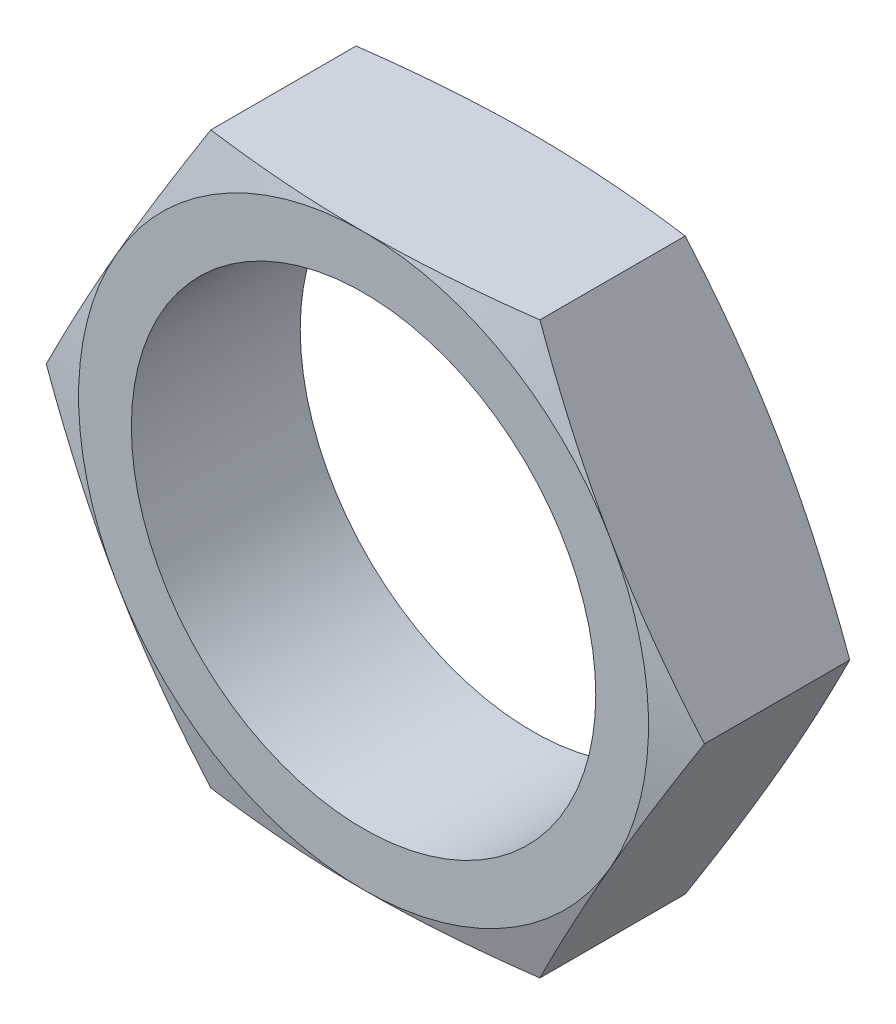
ISO-10303-21;
HEADER;
FILE_DESCRIPTION(('STEP AP214'),'2;1');
FILE_NAME('part.step','',(''),(''),'','','');
FILE_SCHEMA(('AUTOMOTIVE_DESIGN { 1 0 10303 214 1 1 1 1 }'));
ENDSEC;
DATA;
#1=APPLICATION_CONTEXT('core data for automotive mechanical design processes');
#2=APPLICATION_PROTOCOL_DEFINITION('international standard','automotive_design',2000,#1);
#3=PRODUCT_CONTEXT('',#1,'mechanical');
#4=PRODUCT('Part','Part','',(#3));
#5=PRODUCT_RELATED_PRODUCT_CATEGORY('part','',(#4));
#6=PRODUCT_DEFINITION_FORMATION('','',#4);
#7=PRODUCT_DEFINITION_CONTEXT('part definition',#1,'design');
#8=PRODUCT_DEFINITION('design','',#6,#7);
#9=PRODUCT_DEFINITION_SHAPE('','',#8);
#10=(LENGTH_UNIT() NAMED_UNIT(*) SI_UNIT(.MILLI.,.METRE.));
#11=(NAMED_UNIT(*) PLANE_ANGLE_UNIT() SI_UNIT($,.RADIAN.));
#12=(NAMED_UNIT(*) SI_UNIT($,.STERADIAN.) SOLID_ANGLE_UNIT());
#13=UNCERTAINTY_MEASURE_WITH_UNIT(LENGTH_MEASURE(1.E-05),#10,'distance_accuracy_value','');
#14=(GEOMETRIC_REPRESENTATION_CONTEXT(3) GLOBAL_UNCERTAINTY_ASSIGNED_CONTEXT((#13)) GLOBAL_UNIT_ASSIGNED_CONTEXT((#10,
#11,#12)) REPRESENTATION_CONTEXT('',''));
#15=CARTESIAN_POINT('',(0.,0.,0.));
#16=DIRECTION('',(0.,0.,1.));
#17=DIRECTION('',(1.,0.,0.));
#18=AXIS2_PLACEMENT_3D('',#15,#16,#17);
#19=CARTESIAN_POINT('',(0.,0.,8.));
#20=DIRECTION('',(0.,0.,-1.));
#21=DIRECTION('',(-1.,0.,0.));
#22=AXIS2_PLACEMENT_3D('',#19,#20,#21);
#23=CONICAL_SURFACE('',#22,13.5,1.30899693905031);
#24=CARTESIAN_POINT('',(6.92223115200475E-10,13.5,8.));
#25=CARTESIAN_POINT('',(-0.32607712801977,13.5,8.00001861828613));
#26=CARTESIAN_POINT('',(-0.65215132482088,13.5,7.99683485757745));
#27=CARTESIAN_POINT('',(-1.30416819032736,13.5,7.98419942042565));
#28=CARTESIAN_POINT('',(-1.63011086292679,13.5,7.9747479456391));
#29=CARTESIAN_POINT('',(-2.28139265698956,13.5,7.94972801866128));
#30=CARTESIAN_POINT('',(-2.60673204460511,13.5,7.93416647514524));
#31=CARTESIAN_POINT('',(-3.2570737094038,13.5,7.89718400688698));
#32=CARTESIAN_POINT('',(-3.5820759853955,13.5,7.87576306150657));
#33=CARTESIAN_POINT('',(-4.55629857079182,13.5,7.80319088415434));
#34=CARTESIAN_POINT('',(-5.20491563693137,13.5,7.74372302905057));
#35=CARTESIAN_POINT('',(-6.17663829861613,13.5,7.64016666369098));
#36=CARTESIAN_POINT('',(-6.50053840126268,13.5,7.603229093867));
#37=CARTESIAN_POINT('',(-7.14778905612,13.5,7.52498678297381));
#38=CARTESIAN_POINT('',(-7.47113964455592,13.5,7.48368234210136));
#39=CARTESIAN_POINT('',(-7.79422863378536,13.5,7.44039956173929));
#40=B_SPLINE_CURVE_WITH_KNOTS('',3,(#24,#25,#26,#27,#28,#29,#30,#31,#32,#33,#34,#35,#36,#37,#38,
#39),.UNSPECIFIED.,.F.,.F.,(4,2,2,2,2,2,2,4),(0.,0.978210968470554,1.9563904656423,
2.93346710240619,3.91054718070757,5.86416419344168,6.84214128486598,7.82005118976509),.UNSPECIFIED.);
#41=CARTESIAN_POINT('',(1.38444664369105E-09,13.5,8.));
#42=VERTEX_POINT('',#41);
#43=CARTESIAN_POINT('',(-7.79422863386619,13.5,7.44039956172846));
#44=VERTEX_POINT('',#43);
#45=EDGE_CURVE('E124',#42,#44,#40,.T.);
#46=ORIENTED_EDGE('',*,*,#45,.T.);
#47=CARTESIAN_POINT('',(-7.79422863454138,13.5000000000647,7.44039956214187));
#48=CARTESIAN_POINT('',(-7.95577312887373,13.2201967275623,7.48368234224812));
#49=CARTESIAN_POINT('',(-8.11744842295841,12.9401669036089,7.52498678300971));
#50=CARTESIAN_POINT('',(-8.44107375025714,12.3796313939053,7.60322909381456));
#51=CARTESIAN_POINT('',(-8.60302380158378,12.0991256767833,7.64016666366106));
#52=CARTESIAN_POINT('',(-9.08888513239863,11.2575891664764,7.74372302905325));
#53=CARTESIAN_POINT('',(-9.41319366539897,10.6958703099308,7.803190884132));
#54=CARTESIAN_POINT('',(-9.90030495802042,9.85216880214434,7.87576306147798));
#55=CARTESIAN_POINT('',(-10.0628060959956,9.57070857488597,7.89718400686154));
#56=CARTESIAN_POINT('',(-10.3879769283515,9.00749617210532,7.93416647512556));
#57=CARTESIAN_POINT('',(-10.5506466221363,8.72574399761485,7.94972801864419));
#58=CARTESIAN_POINT('',(-10.8762875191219,8.16171741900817,7.97474794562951));
#59=CARTESIAN_POINT('',(-11.0392588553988,7.87944278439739,7.98419942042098));
#60=CARTESIAN_POINT('',(-11.3652672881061,7.31477961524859,7.99683485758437));
#61=CARTESIAN_POINT('',(-11.5283043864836,7.03239107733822,8.00001861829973));
#62=CARTESIAN_POINT('',(-11.6913429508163,6.75000000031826,8.00000000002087));
#63=B_SPLINE_CURVE_WITH_KNOTS('',3,(#47,#48,#49,#50,#51,#52,#53,#54,#55,#56,#57,#58,#59,#60,#61,
#62),.UNSPECIFIED.,.F.,.F.,(4,2,2,2,2,2,2,4),(0.,0.977909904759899,1.95588699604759,
3.90950400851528,4.88658408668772,5.86366072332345,6.84184022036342,7.82005118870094),.UNSPECIFIED.);
#64=CARTESIAN_POINT('',(-11.6913429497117,6.75000000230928,8.));
#65=VERTEX_POINT('',#64);
#66=EDGE_CURVE('E375',#44,#65,#63,.T.);
#67=ORIENTED_EDGE('',*,*,#66,.T.);
#68=CARTESIAN_POINT('',(0.,0.,8.));
#69=DIRECTION('',(0.,0.,-1.));
#70=DIRECTION('',(-1.,0.,0.));
#71=AXIS2_PLACEMENT_3D('',#68,#69,#70);
#72=CIRCLE('',#71,13.5);
#73=EDGE_CURVE('E362',#42,#65,#72,.F.);
#74=ORIENTED_EDGE('',*,*,#73,.F.);
#75=EDGE_LOOP('',(#46,#67,#74));
#76=FACE_BOUND('',#75,.T.);
#77=ADVANCED_FACE('F16',(#76),#23,.T.);
#78=CARTESIAN_POINT('',(0.,0.,8.));
#79=DIRECTION('',(0.,0.,-1.));
#80=DIRECTION('',(-1.,0.,0.));
#81=AXIS2_PLACEMENT_3D('',#78,#79,#80);
#82=CONICAL_SURFACE('',#81,13.5,1.30899693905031);
#83=CARTESIAN_POINT('',(0.,0.,8.00000000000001));
#84=DIRECTION('',(0.,0.,-1.));
#85=DIRECTION('',(-1.,0.,0.));
#86=AXIS2_PLACEMENT_3D('',#83,#84,#85);
#87=CIRCLE('',#86,13.5);
#88=CARTESIAN_POINT('',(-11.6913429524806,-6.74999999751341,8.));
#89=VERTEX_POINT('',#88);
#90=EDGE_CURVE('E360',#65,#89,#87,.F.);
#91=ORIENTED_EDGE('',*,*,#90,.F.);
#92=CARTESIAN_POINT('',(-11.6913429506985,6.75000000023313,7.99999999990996));
#93=CARTESIAN_POINT('',(-11.8543815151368,6.46760892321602,8.00001861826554));
#94=CARTESIAN_POINT('',(-12.0174186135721,6.18522038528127,7.99683485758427));
#95=CARTESIAN_POINT('',(-12.3434270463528,5.62055721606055,7.98419942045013));
#96=CARTESIAN_POINT('',(-12.5063983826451,5.33828258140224,7.97474794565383));
#97=CARTESIAN_POINT('',(-12.8320392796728,4.7742560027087,7.94972801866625));
#98=CARTESIAN_POINT('',(-12.9947089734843,4.4925038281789,7.93416647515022));
#99=CARTESIAN_POINT('',(-13.319879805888,3.92929142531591,7.89718400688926));
#100=CARTESIAN_POINT('',(-13.4823809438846,3.64783119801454,7.87576306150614));
#101=CARTESIAN_POINT('',(-13.9694922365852,2.80412969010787,7.80319088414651));
#102=CARTESIAN_POINT('',(-14.2938007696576,2.2424108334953,7.7437230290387));
#103=CARTESIAN_POINT('',(-14.7796621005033,1.40087432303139,7.64016666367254));
#104=CARTESIAN_POINT('',(-14.9416121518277,1.12036860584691,7.60322909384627));
#105=CARTESIAN_POINT('',(-15.2652374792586,0.559833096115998,7.52498678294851));
#106=CARTESIAN_POINT('',(-15.4269127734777,0.279803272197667,7.48368234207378));
#107=CARTESIAN_POINT('',(-15.5884572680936,-1.62179985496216E-10,7.44039956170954));
#108=B_SPLINE_CURVE_WITH_KNOTS('',3,(#92,#93,#94,#95,#96,#97,#98,#99,#100,#101,#102,#103,#104,
#105,#106,#107),.UNSPECIFIED.,.F.,.F.,(4,2,2,2,2,2,2,4),(0.,0.978210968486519,1.95639046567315,
2.93346710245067,3.91054718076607,5.8641641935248,6.84214128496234,7.82005118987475),.UNSPECIFIED.);
#109=CARTESIAN_POINT('',(-15.5884572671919,-1.39974413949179E-09,7.44039956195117));
#110=VERTEX_POINT('',#109);
#111=EDGE_CURVE('E373',#65,#110,#108,.T.);
#112=ORIENTED_EDGE('',*,*,#111,.T.);
#113=CARTESIAN_POINT('',(-15.5884572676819,-5.51033328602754E-10,7.44039956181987));
#114=CARTESIAN_POINT('',(-15.4269127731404,-0.279803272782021,7.48368234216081));
#115=CARTESIAN_POINT('',(-15.2652374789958,-0.559833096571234,7.5249867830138));
#116=CARTESIAN_POINT('',(-14.9416121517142,-1.12036860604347,7.60322909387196));
#117=CARTESIAN_POINT('',(-14.7796621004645,-1.40087432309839,7.64016666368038));
#118=CARTESIAN_POINT('',(-14.2938007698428,-2.24241083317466,7.74372302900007));
#119=CARTESIAN_POINT('',(-13.9694922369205,-2.80412968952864,7.80319088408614));
#120=CARTESIAN_POINT('',(-13.4823809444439,-3.64783119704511,7.87576306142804));
#121=CARTESIAN_POINT('',(-13.319879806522,-3.92929142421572,7.89718400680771));
#122=CARTESIAN_POINT('',(-12.9947089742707,-4.4925038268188,7.93416647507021));
#123=CARTESIAN_POINT('',(-12.832039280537,-4.77425600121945,7.94972801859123));
#124=CARTESIAN_POINT('',(-12.5063983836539,-5.3382825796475,7.97474794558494));
#125=CARTESIAN_POINT('',(-12.3434270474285,-5.62055721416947,7.98419942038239));
#126=CARTESIAN_POINT('',(-12.0174186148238,-6.1852203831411,7.99683485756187));
#127=CARTESIAN_POINT('',(-11.8543815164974,-6.46760892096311,8.00001861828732));
#128=CARTESIAN_POINT('',(-11.6913429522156,-6.74999999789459,8.00000000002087));
#129=B_SPLINE_CURVE_WITH_KNOTS('',3,(#113,#114,#115,#116,#117,#118,#119,#120,#121,#122,#123,
#124,#125,#126,#127,#128),.UNSPECIFIED.,.F.,.F.,(4,2,2,2,2,2,2,4),(0.,0.977909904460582,
1.95588699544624,3.90950400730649,4.88658408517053,5.86366072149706,6.84184021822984,
7.82005118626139),.UNSPECIFIED.);
#130=EDGE_CURVE('E326',#110,#89,#129,.T.);
#131=ORIENTED_EDGE('',*,*,#130,.T.);
#132=EDGE_LOOP('',(#91,#112,#131));
#133=FACE_BOUND('',#132,.T.);
#134=ADVANCED_FACE('F336',(#133),#82,.T.);
#135=CARTESIAN_POINT('',(0.,0.,8.));
#136=DIRECTION('',(0.,0.,-1.));
#137=DIRECTION('',(-1.,0.,0.));
#138=AXIS2_PLACEMENT_3D('',#135,#136,#137);
#139=CONICAL_SURFACE('',#138,13.5,1.30899693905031);
#140=CARTESIAN_POINT('',(-11.691342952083,-6.74999999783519,7.99999999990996));
#141=CARTESIAN_POINT('',(-11.5283043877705,-7.03239107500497,8.00001861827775));
#142=CARTESIAN_POINT('',(-11.3652672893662,-7.31477961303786,7.99683485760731));
#143=CARTESIAN_POINT('',(-11.0392588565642,-7.8794427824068,7.98419942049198));
#144=CARTESIAN_POINT('',(-10.8762875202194,-8.16171741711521,7.97474794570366));
#145=CARTESIAN_POINT('',(-10.5506466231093,-8.72574399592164,7.94972801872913));
#146=CARTESIAN_POINT('',(-10.3879769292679,-9.00749617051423,7.93416647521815));
#147=CARTESIAN_POINT('',(-10.0628060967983,-9.5707085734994,7.89718400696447));
#148=CARTESIAN_POINT('',(-9.90030495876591,-9.85216880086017,7.87576306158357));
#149=CARTESIAN_POINT('',(-9.41319366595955,-10.6958703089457,7.80319088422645));
#150=CARTESIAN_POINT('',(-9.08888513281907,-11.2575891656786,7.74372302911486));
#151=CARTESIAN_POINT('',(-8.60302380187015,-12.0991256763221,7.64016666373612));
#152=CARTESIAN_POINT('',(-8.44107375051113,-12.3796313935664,7.60322909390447));
#153=CARTESIAN_POINT('',(-8.1174484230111,-12.9401669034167,7.52498678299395));
#154=CARTESIAN_POINT('',(-7.95577312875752,-13.2201967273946,7.48368234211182));
#155=CARTESIAN_POINT('',(-7.79422863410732,-13.4999999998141,7.44039956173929));
#156=B_SPLINE_CURVE_WITH_KNOTS('',3,(#140,#141,#142,#143,#144,#145,#146,#147,#148,#149,#150,
#151,#152,#153,#154,#155),.UNSPECIFIED.,.F.,.F.,(4,2,2,2,2,2,2,4),(0.,0.978210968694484,
1.95639046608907,2.93346710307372,3.91054718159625,5.86416419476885,6.84214128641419,
7.82005119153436),.UNSPECIFIED.);
#157=CARTESIAN_POINT('',(-7.79422863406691,-13.4999999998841,7.44039956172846));
#158=VERTEX_POINT('',#157);
#159=EDGE_CURVE('E319',#89,#158,#156,.T.);
#160=ORIENTED_EDGE('',*,*,#159,.T.);
#161=CARTESIAN_POINT('',(-7.79422863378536,-13.5000000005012,7.44039956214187));
#162=CARTESIAN_POINT('',(-7.47113964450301,-13.5000000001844,7.48368234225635));
#163=CARTESIAN_POINT('',(-7.14778905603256,-13.5000000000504,7.52498678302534));
#164=CARTESIAN_POINT('',(-6.50053840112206,-13.4999999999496,7.60322909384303));
#165=CARTESIAN_POINT('',(-6.17663829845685,-13.4999999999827,7.64016666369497));
#166=CARTESIAN_POINT('',(-5.20491563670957,-13.5000000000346,7.74372302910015));
#167=CARTESIAN_POINT('',(-4.55629857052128,-13.5000000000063,7.80319088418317));
#168=CARTESIAN_POINT('',(-3.5820759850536,-13.4999999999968,7.8757630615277));
#169=CARTESIAN_POINT('',(-3.25707370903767,-13.4999999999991,7.89718400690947));
#170=CARTESIAN_POINT('',(-2.60673204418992,-13.5000000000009,7.93416647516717));
#171=CARTESIAN_POINT('',(-2.28139265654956,-13.5000000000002,7.94972801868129));
#172=CARTESIAN_POINT('',(-1.63011086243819,-13.4999999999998,7.97474794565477));
#173=CARTESIAN_POINT('',(-1.30416818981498,-13.4999999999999,7.98419942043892));
#174=CARTESIAN_POINT('',(-0.652151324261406,-13.5000000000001,7.99683485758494));
#175=CARTESIAN_POINT('',(-0.326077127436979,-13.5000000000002,8.00001861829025));
#176=CARTESIAN_POINT('',(1.29832846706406E-09,-13.5,8.));
#177=B_SPLINE_CURVE_WITH_KNOTS('',3,(#161,#162,#163,#164,#165,#166,#167,#168,#169,#170,#171,
#172,#173,#174,#175,#176),.UNSPECIFIED.,.F.,.F.,(4,2,2,2,2,2,2,4),(0.,0.9779099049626,
1.95588699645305,3.90950400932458,4.88658408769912,5.86366072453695,6.84184022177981,
7.82005119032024),.UNSPECIFIED.);
#178=CARTESIAN_POINT('',(2.5966561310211E-09,-13.5,8.));
#179=VERTEX_POINT('',#178);
#180=EDGE_CURVE('E343',#158,#179,#177,.T.);
#181=ORIENTED_EDGE('',*,*,#180,.T.);
#182=CARTESIAN_POINT('',(0.,0.,8.));
#183=DIRECTION('',(0.,0.,-1.));
#184=DIRECTION('',(-1.,0.,0.));
#185=AXIS2_PLACEMENT_3D('',#182,#183,#184);
#186=CIRCLE('',#185,13.5);
#187=EDGE_CURVE('E358',#89,#179,#186,.F.);
#188=ORIENTED_EDGE('',*,*,#187,.F.);
#189=EDGE_LOOP('',(#160,#181,#188));
#190=FACE_BOUND('',#189,.T.);
#191=ADVANCED_FACE('F333',(#190),#139,.T.);
#192=CARTESIAN_POINT('',(0.,0.,8.));
#193=DIRECTION('',(0.,0.,-1.));
#194=DIRECTION('',(-1.,0.,0.));
#195=AXIS2_PLACEMENT_3D('',#192,#193,#194);
#196=CONICAL_SURFACE('',#195,13.5,1.30899693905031);
#197=CARTESIAN_POINT('',(11.6913429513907,6.74999999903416,7.99999999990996));
#198=CARTESIAN_POINT('',(11.5283043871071,7.03239107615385,8.00001861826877));
#199=CARTESIAN_POINT('',(11.3652672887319,7.31477961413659,7.99683485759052));
#200=CARTESIAN_POINT('',(11.0392588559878,7.87944278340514,7.98419942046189));
#201=CARTESIAN_POINT('',(10.876287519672,8.16171741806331,7.9747479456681));
#202=CARTESIAN_POINT('',(10.5506466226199,8.72574399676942,7.94972801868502));
#203=CARTESIAN_POINT('',(10.3879769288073,9.00749617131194,7.93416647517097));
#204=CARTESIAN_POINT('',(10.0628060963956,9.570708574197,7.89718400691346));
#205=CARTESIAN_POINT('',(9.90030495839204,9.85216880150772,7.87576306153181));
#206=CARTESIAN_POINT('',(9.41319366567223,10.6958703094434,7.80319088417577));
#207=CARTESIAN_POINT('',(9.08888513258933,11.2575891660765,7.74372302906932));
#208=CARTESIAN_POINT('',(8.60302380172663,12.0991256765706,7.64016666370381));
#209=CARTESIAN_POINT('',(8.44107375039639,12.3796313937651,7.60322909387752));
#210=CARTESIAN_POINT('',(8.1174484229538,12.940166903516,7.52498678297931));
#211=CARTESIAN_POINT('',(7.95577312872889,13.2201967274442,7.48368234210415));
#212=CARTESIAN_POINT('',(7.79422863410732,13.4999999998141,7.44039956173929));
#213=B_SPLINE_CURVE_WITH_KNOTS('',3,(#197,#198,#199,#200,#201,#202,#203,#204,#205,#206,#207,
#208,#209,#210,#211,#212),.UNSPECIFIED.,.F.,.F.,(4,2,2,2,2,2,2,4),(0.,0.97821096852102,
1.95639046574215,2.93346710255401,3.91054718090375,5.86416419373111,6.84214128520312,
7.82005119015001),.UNSPECIFIED.);
#214=CARTESIAN_POINT('',(11.6913429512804,6.74999999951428,8.00000000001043));
#215=VERTEX_POINT('',#214);
#216=CARTESIAN_POINT('',(7.79422863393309,13.4999999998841,7.44039956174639));
#217=VERTEX_POINT('',#216);
#218=EDGE_CURVE('E109',#215,#217,#213,.T.);
#219=ORIENTED_EDGE('',*,*,#218,.T.);
#220=CARTESIAN_POINT('',(7.79422863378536,13.5000000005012,7.44039956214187));
#221=CARTESIAN_POINT('',(7.47113964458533,13.5000000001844,7.48368234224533));
#222=CARTESIAN_POINT('',(7.14778905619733,13.5000000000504,7.52498678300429));
#223=CARTESIAN_POINT('',(6.50053840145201,13.4999999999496,7.60322909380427));
#224=CARTESIAN_POINT('',(6.17663829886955,13.4999999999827,7.64016666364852));
#225=CARTESIAN_POINT('',(5.2049156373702,13.5000000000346,7.74372302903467));
#226=CARTESIAN_POINT('',(4.55629857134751,13.5000000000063,7.8031908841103));
#227=CARTESIAN_POINT('',(3.5820759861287,13.4999999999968,7.87576306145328));
#228=CARTESIAN_POINT('',(3.25707371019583,13.4999999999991,7.89718400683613));
#229=CARTESIAN_POINT('',(2.6067320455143,13.5000000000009,7.93416647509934));
#230=CARTESIAN_POINT('',(2.28139265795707,13.5000000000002,7.94972801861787));
#231=CARTESIAN_POINT('',(1.63011086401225,13.4999999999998,7.97474794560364));
#232=CARTESIAN_POINT('',(1.30416819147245,13.4999999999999,7.98419942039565));
#233=CARTESIAN_POINT('',(0.652151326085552,13.5000000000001,7.99683485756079));
#234=CARTESIAN_POINT('',(0.326077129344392,13.5000000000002,8.00001861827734));
#235=CARTESIAN_POINT('',(6.92223610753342E-10,13.5,8.));
#236=B_SPLINE_CURVE_WITH_KNOTS('',3,(#220,#221,#222,#223,#224,#225,#226,#227,#228,#229,#230,
#231,#232,#233,#234,#235),.UNSPECIFIED.,.F.,.F.,(4,2,2,2,2,2,2,4),(0.,0.977909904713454,
1.95588699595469,3.90950400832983,4.88658408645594,5.86366072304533,6.8418402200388,
7.82005118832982),.UNSPECIFIED.);
#237=EDGE_CURVE('E20',#217,#42,#236,.T.);
#238=ORIENTED_EDGE('',*,*,#237,.T.);
#239=CARTESIAN_POINT('',(0.,0.,8.));
#240=DIRECTION('',(0.,0.,-1.));
#241=DIRECTION('',(-1.,0.,0.));
#242=AXIS2_PLACEMENT_3D('',#239,#240,#241);
#243=CIRCLE('',#242,13.5);
#244=EDGE_CURVE('E113',#215,#42,#243,.F.);
#245=ORIENTED_EDGE('',*,*,#244,.F.);
#246=EDGE_LOOP('',(#219,#238,#245));
#247=FACE_BOUND('',#246,.T.);
#248=ADVANCED_FACE('F111',(#247),#196,.T.);
#249=CARTESIAN_POINT('',(-7.794228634,13.5,8.048));
#250=DIRECTION('',(0.,-1.,0.));
#251=DIRECTION('',(0.,0.,-1.));
#252=AXIS2_PLACEMENT_3D('',#249,#250,#251);
#253=PLANE('',#252);
#254=CARTESIAN_POINT('',(7.79422863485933,13.5000000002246,0.55960043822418));
#255=CARTESIAN_POINT('',(7.47113964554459,13.5000000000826,0.516317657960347));
#256=CARTESIAN_POINT('',(7.14778905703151,13.5000000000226,0.475013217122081));
#257=CARTESIAN_POINT('',(6.50053840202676,13.4999999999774,0.396770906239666));
#258=CARTESIAN_POINT('',(6.17663829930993,13.4999999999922,0.359833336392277));
#259=CARTESIAN_POINT('',(5.20491563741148,13.5000000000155,0.256276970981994));
#260=CARTESIAN_POINT('',(4.55629857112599,13.5000000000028,0.196809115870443));
#261=CARTESIAN_POINT('',(3.58207598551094,13.4999999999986,0.124236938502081));
#262=CARTESIAN_POINT('',(3.25707370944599,13.4999999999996,0.102815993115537));
#263=CARTESIAN_POINT('',(2.60673204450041,13.5000000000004,0.0658335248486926));
#264=CARTESIAN_POINT('',(2.2813926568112,13.5000000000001,0.0502719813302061));
#265=CARTESIAN_POINT('',(1.63011086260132,13.4999999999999,0.0252520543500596));
#266=CARTESIAN_POINT('',(1.30416818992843,13.4999999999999,0.0158005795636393));
#267=CARTESIAN_POINT('',(0.652151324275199,13.5000000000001,0.00316514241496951));
#268=CARTESIAN_POINT('',(0.326077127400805,13.5000000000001,-1.86182907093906E-05));
#269=CARTESIAN_POINT('',(-1.38444674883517E-09,13.5,0.));
#270=B_SPLINE_CURVE_WITH_KNOTS('',3,(#254,#255,#256,#257,#258,#259,#260,#261,#262,#263,#264,
#265,#266,#267,#268,#269),.UNSPECIFIED.,.F.,.F.,(4,2,2,2,2,2,2,4),(0.,0.977909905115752,
1.95588699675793,3.90950400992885,4.88658408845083,5.86366072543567,6.84184022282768,
7.82005119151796),.UNSPECIFIED.);
#271=CARTESIAN_POINT('',(7.79422863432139,13.4999999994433,0.559600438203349));
#272=VERTEX_POINT('',#271);
#273=CARTESIAN_POINT('',(-1.38444664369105E-09,13.5,0.));
#274=VERTEX_POINT('',#273);
#275=EDGE_CURVE('E130',#272,#274,#270,.T.);
#276=ORIENTED_EDGE('',*,*,#275,.T.);
#277=CARTESIAN_POINT('',(-1.38444664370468E-09,13.5,0.));
#278=CARTESIAN_POINT('',(-0.326077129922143,13.5,-1.86182726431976E-05));
#279=CARTESIAN_POINT('',(-0.652151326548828,13.5,0.00316514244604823));
#280=CARTESIAN_POINT('',(-1.30416819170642,13.5,0.0158005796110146));
#281=CARTESIAN_POINT('',(-1.63011086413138,13.5,0.025252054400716));
#282=CARTESIAN_POINT('',(-2.28139265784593,13.5,0.0502719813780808));
#283=CARTESIAN_POINT('',(-2.60673204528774,13.5,0.0658335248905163));
#284=CARTESIAN_POINT('',(-3.25707370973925,13.5,0.102815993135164));
#285=CARTESIAN_POINT('',(-3.58207598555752,13.5,0.124236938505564));
#286=CARTESIAN_POINT('',(-4.55629857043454,13.5,0.196809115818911));
#287=CARTESIAN_POINT('',(-5.20491563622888,13.5,0.256276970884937));
#288=CARTESIAN_POINT('',(-6.17663829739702,13.5,0.359833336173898));
#289=CARTESIAN_POINT('',(-6.50053839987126,13.5,0.396770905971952));
#290=CARTESIAN_POINT('',(-7.14778905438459,13.5,0.475013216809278));
#291=CARTESIAN_POINT('',(-7.47113964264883,13.5,0.516317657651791));
#292=CARTESIAN_POINT('',(-7.79422863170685,13.5,0.559600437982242));
#293=B_SPLINE_CURVE_WITH_KNOTS('',3,(#277,#278,#279,#280,#281,#282,#283,#284,#285,#286,#287,
#288,#289,#290,#291,#292),.UNSPECIFIED.,.F.,.F.,(4,2,2,2,2,2,2,4),(0.,0.978210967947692,
1.95639046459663,2.93346710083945,3.91054717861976,5.86416419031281,6.84214128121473,
7.82005118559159),.UNSPECIFIED.);
#294=CARTESIAN_POINT('',(-7.79422863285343,13.5,0.559600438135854));
#295=VERTEX_POINT('',#294);
#296=EDGE_CURVE('E222',#274,#295,#293,.T.);
#297=ORIENTED_EDGE('',*,*,#296,.T.);
#298=DIRECTION('',(0.,0.,1.));
#299=VECTOR('',#298,1.);
#300=CARTESIAN_POINT('',(-7.794228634,13.5,4.));
#301=LINE('',#300,#299);
#302=EDGE_CURVE('E372',#295,#44,#301,.T.);
#303=ORIENTED_EDGE('',*,*,#302,.T.);
#304=ORIENTED_EDGE('',*,*,#45,.F.);
#305=ORIENTED_EDGE('',*,*,#237,.F.);
#306=DIRECTION('',(0.,0.,-1.));
#307=VECTOR('',#306,1.);
#308=CARTESIAN_POINT('',(7.794228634,13.5,4.));
#309=LINE('',#308,#307);
#310=EDGE_CURVE('E116',#217,#272,#309,.T.);
#311=ORIENTED_EDGE('',*,*,#310,.T.);
#312=EDGE_LOOP('',(#276,#297,#303,#304,#305,#311));
#313=FACE_BOUND('',#312,.T.);
#314=ADVANCED_FACE('F121',(#313),#253,.F.);
#315=CARTESIAN_POINT('',(-15.588457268,0.,-0.048));
#316=DIRECTION('',(0.866025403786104,-0.499999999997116,0.));
#317=DIRECTION('',(0.499999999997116,0.866025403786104,0.));
#318=AXIS2_PLACEMENT_3D('',#315,#316,#317);
#319=PLANE('',#318);
#320=CARTESIAN_POINT('',(-7.7942286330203,13.5000000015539,0.559600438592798));
#321=CARTESIAN_POINT('',(-7.95577312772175,13.2201967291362,0.516317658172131));
#322=CARTESIAN_POINT('',(-8.11744842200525,12.9401669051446,0.475013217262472));
#323=CARTESIAN_POINT('',(-8.44107374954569,12.3796313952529,0.396770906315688));
#324=CARTESIAN_POINT('',(-8.60302380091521,12.0991256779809,0.359833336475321));
#325=CARTESIAN_POINT('',(-9.08888513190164,11.2575891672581,0.25627697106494));
#326=CARTESIAN_POINT('',(-9.41319366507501,10.6958703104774,0.196809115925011));
#327=CARTESIAN_POINT('',(-9.90030495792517,9.85216880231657,0.124236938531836));
#328=CARTESIAN_POINT('',(-10.0628060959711,9.57070857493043,0.102815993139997));
#329=CARTESIAN_POINT('',(-10.3879769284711,9.0074961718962,0.0658335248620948));
#330=CARTESIAN_POINT('',(-10.5506466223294,8.72574399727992,0.0502719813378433));
#331=CARTESIAN_POINT('',(-10.8762875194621,8.16171741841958,0.0252520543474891));
#332=CARTESIAN_POINT('',(-11.0392588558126,7.87944278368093,0.0158005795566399));
#333=CARTESIAN_POINT('',(-11.3652672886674,7.31477961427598,0.00316514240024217));
#334=CARTESIAN_POINT('',(-11.5283043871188,7.03239107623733,-1.86183087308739E-05));
#335=CARTESIAN_POINT('',(-11.6913429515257,6.74999999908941,-2.08659014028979E-11));
#336=B_SPLINE_CURVE_WITH_KNOTS('',3,(#320,#321,#322,#323,#324,#325,#326,#327,#328,#329,#330,
#331,#332,#333,#334,#335),.UNSPECIFIED.,.F.,.F.,(4,2,2,2,2,2,2,4),(0.,0.9779099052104,
1.95588699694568,3.909504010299,4.88658408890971,5.86366072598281,6.84184022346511,
7.82005119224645),.UNSPECIFIED.);
#337=CARTESIAN_POINT('',(-11.6913429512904,6.74999999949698,-1.04329507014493E-11));
#338=VERTEX_POINT('',#337);
#339=EDGE_CURVE('E217',#295,#338,#336,.T.);
#340=ORIENTED_EDGE('',*,*,#339,.T.);
#341=CARTESIAN_POINT('',(-11.6913429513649,6.7499999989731,1.30643873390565E-10));
#342=CARTESIAN_POINT('',(-11.8543815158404,6.46760892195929,-1.86182417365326E-05));
#343=CARTESIAN_POINT('',(-12.0174186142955,6.18522038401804,0.00316514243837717));
#344=CARTESIAN_POINT('',(-12.3434270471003,5.62055721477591,0.0158005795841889));
#345=CARTESIAN_POINT('',(-12.506398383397,5.33828258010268,0.0252520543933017));
#346=CARTESIAN_POINT('',(-12.8320392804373,4.77425600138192,0.0502719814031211));
#347=CARTESIAN_POINT('',(-12.994708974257,4.49250382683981,0.0658335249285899));
#348=CARTESIAN_POINT('',(-13.3198798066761,3.9292914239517,0.102815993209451));
#349=CARTESIAN_POINT('',(-13.4823809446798,3.64783119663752,0.124236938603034));
#350=CARTESIAN_POINT('',(-13.9694922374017,2.80412968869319,0.196809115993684));
#351=CARTESIAN_POINT('',(-14.2938007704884,2.24241083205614,0.256276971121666));
#352=CARTESIAN_POINT('',(-14.7796621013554,1.40087432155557,0.359833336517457));
#353=CARTESIAN_POINT('',(-14.9416121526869,1.12036860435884,0.396770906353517));
#354=CARTESIAN_POINT('',(-15.2652374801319,0.559833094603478,0.475013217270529));
#355=CARTESIAN_POINT('',(-15.426912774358,0.27980327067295,0.516317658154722));
#356=CARTESIAN_POINT('',(-15.588457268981,-1.6990581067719E-09,0.559600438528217));
#357=B_SPLINE_CURVE_WITH_KNOTS('',3,(#341,#342,#343,#344,#345,#346,#347,#348,#349,#350,#351,
#352,#353,#354,#355,#356),.UNSPECIFIED.,.F.,.F.,(4,2,2,2,2,2,2,4),(0.,0.978210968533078,
1.95639046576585,2.93346710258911,3.91054718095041,5.86416419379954,6.84214128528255,
7.82005119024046),.UNSPECIFIED.);
#358=CARTESIAN_POINT('',(-15.588457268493,-8.53857345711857E-10,0.559600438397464));
#359=VERTEX_POINT('',#358);
#360=EDGE_CURVE('E228',#338,#359,#357,.T.);
#361=ORIENTED_EDGE('',*,*,#360,.T.);
#362=DIRECTION('',(0.,0.,1.));
#363=VECTOR('',#362,1.);
#364=CARTESIAN_POINT('',(-15.588457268,0.,4.));
#365=LINE('',#364,#363);
#366=EDGE_CURVE('E325',#359,#110,#365,.T.);
#367=ORIENTED_EDGE('',*,*,#366,.T.);
#368=ORIENTED_EDGE('',*,*,#111,.F.);
#369=ORIENTED_EDGE('',*,*,#66,.F.);
#370=ORIENTED_EDGE('',*,*,#302,.F.);
#371=EDGE_LOOP('',(#340,#361,#367,#368,#369,#370));
#372=FACE_BOUND('',#371,.T.);
#373=ADVANCED_FACE('F311',(#372),#319,.F.);
#374=CARTESIAN_POINT('',(-7.794228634,-13.5,-0.048));
#375=DIRECTION('',(0.866025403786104,0.499999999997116,0.));
#376=DIRECTION('',(-0.499999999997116,0.866025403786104,0.));
#377=AXIS2_PLACEMENT_3D('',#374,#375,#376);
#378=PLANE('',#377);
#379=CARTESIAN_POINT('',(-15.5884572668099,-2.06132452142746E-09,0.559600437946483));
#380=CARTESIAN_POINT('',(-15.4269127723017,-0.279803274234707,0.51631765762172));
#381=CARTESIAN_POINT('',(-15.2652374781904,-0.559833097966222,0.475013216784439));
#382=CARTESIAN_POINT('',(-14.9416121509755,-1.12036860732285,0.396770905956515));
#383=CARTESIAN_POINT('',(-14.7796620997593,-1.40087432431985,0.359833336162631));
#384=CARTESIAN_POINT('',(-14.2938007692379,-2.24241083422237,0.25627697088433));
#385=CARTESIAN_POINT('',(-13.9694922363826,-2.80412969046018,0.196809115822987));
#386=CARTESIAN_POINT('',(-13.4823809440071,-3.6478311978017,0.124236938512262));
#387=CARTESIAN_POINT('',(-13.3198798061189,-3.92929142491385,0.102815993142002));
#388=CARTESIAN_POINT('',(-12.9947089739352,-4.49250382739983,0.0658335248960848));
#389=CARTESIAN_POINT('',(-12.8320392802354,-4.77425600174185,0.0502719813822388));
#390=CARTESIAN_POINT('',(-12.5063983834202,-5.33828258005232,0.0252520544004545));
#391=CARTESIAN_POINT('',(-12.3434270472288,-5.62055721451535,0.0158005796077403));
#392=CARTESIAN_POINT('',(-12.0174186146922,-6.18522038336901,0.00316514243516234));
#393=CARTESIAN_POINT('',(-11.8543815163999,-6.467608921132,-1.86182881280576E-05));
#394=CARTESIAN_POINT('',(-11.6913429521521,-6.74999999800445,-2.08663662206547E-11));
#395=B_SPLINE_CURVE_WITH_KNOTS('',3,(#379,#380,#381,#382,#383,#384,#385,#386,#387,#388,#389,
#390,#391,#392,#393,#394),.UNSPECIFIED.,.F.,.F.,(4,2,2,2,2,2,2,4),(0.,0.977909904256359,
1.95588699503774,3.90950400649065,4.88658408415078,5.86366072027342,6.84184021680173,
7.8200511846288),.UNSPECIFIED.);
#396=CARTESIAN_POINT('',(-11.6913429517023,-6.74999999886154,0.));
#397=VERTEX_POINT('',#396);
#398=EDGE_CURVE('E303',#359,#397,#395,.T.);
#399=ORIENTED_EDGE('',*,*,#398,.T.);
#400=CARTESIAN_POINT('',(-11.691342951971,-6.7499999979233,1.30644081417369E-10));
#401=CARTESIAN_POINT('',(-11.5283043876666,-7.03239107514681,-1.86182623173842E-05));
#402=CARTESIAN_POINT('',(-11.3652672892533,-7.31477961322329,0.00316514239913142));
#403=CARTESIAN_POINT('',(-11.039258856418,-7.87944278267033,0.0158005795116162));
#404=CARTESIAN_POINT('',(-10.8762875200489,-8.16171741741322,0.0252520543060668));
#405=CARTESIAN_POINT('',(-10.5506466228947,-8.7257439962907,0.0502719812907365));
#406=CARTESIAN_POINT('',(-10.3879769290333,-9.00749617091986,0.0658335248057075));
#407=CARTESIAN_POINT('',(-10.0628060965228,-9.57070857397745,0.102815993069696));
#408=CARTESIAN_POINT('',(-9.90030495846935,-9.85216880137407,0.124236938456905));
#409=CARTESIAN_POINT('',(-9.4131936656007,-10.6958703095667,0.196809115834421));
#410=CARTESIAN_POINT('',(-9.08888513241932,-11.2575891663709,0.256276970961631));
#411=CARTESIAN_POINT('',(-8.60302380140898,-12.0991256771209,0.359833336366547));
#412=CARTESIAN_POINT('',(-8.44107375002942,-12.3796313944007,0.39677090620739));
#413=CARTESIAN_POINT('',(-8.11744842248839,-12.940166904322,0.47501321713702));
#414=CARTESIAN_POINT('',(-7.95577312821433,-13.2201967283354,0.516317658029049));
#415=CARTESIAN_POINT('',(-7.79422863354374,-13.5000000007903,0.559600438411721));
#416=B_SPLINE_CURVE_WITH_KNOTS('',3,(#400,#401,#402,#403,#404,#405,#406,#407,#408,#409,#410,
#411,#412,#413,#414,#415),.UNSPECIFIED.,.F.,.F.,(4,2,2,2,2,2,2,4),(0.,0.978210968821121,
1.95639046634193,2.933467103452,3.91054718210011,5.86416419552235,6.8421412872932,
7.82005119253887),.UNSPECIFIED.);
#417=CARTESIAN_POINT('',(-7.79422863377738,-13.5000000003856,0.559600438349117));
#418=VERTEX_POINT('',#417);
#419=EDGE_CURVE('E275',#397,#418,#416,.T.);
#420=ORIENTED_EDGE('',*,*,#419,.T.);
#421=DIRECTION('',(0.,0.,1.));
#422=VECTOR('',#421,1.);
#423=CARTESIAN_POINT('',(-7.794228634,-13.5,4.));
#424=LINE('',#423,#422);
#425=EDGE_CURVE('E134',#418,#158,#424,.T.);
#426=ORIENTED_EDGE('',*,*,#425,.T.);
#427=ORIENTED_EDGE('',*,*,#159,.F.);
#428=ORIENTED_EDGE('',*,*,#130,.F.);
#429=ORIENTED_EDGE('',*,*,#366,.F.);
#430=EDGE_LOOP('',(#399,#420,#426,#427,#428,#429));
#431=FACE_BOUND('',#430,.T.);
#432=ADVANCED_FACE('F307',(#431),#378,.F.);
#433=CARTESIAN_POINT('',(-13.662,-13.662,8.));
#434=DIRECTION('',(0.,0.,1.));
#435=DIRECTION('',(1.,0.,0.));
#436=AXIS2_PLACEMENT_3D('',#433,#434,#435);
#437=PLANE('',#436);
#438=CARTESIAN_POINT('',(0.,0.,8.));
#439=DIRECTION('',(0.,0.,-1.));
#440=DIRECTION('',(-1.,0.,0.));
#441=AXIS2_PLACEMENT_3D('',#438,#439,#440);
#442=CIRCLE('',#441,11.);
#443=CARTESIAN_POINT('',(-11.,0.,8.));
#444=VERTEX_POINT('',#443);
#445=EDGE_CURVE('E278',#444,#444,#442,.F.);
#446=ORIENTED_EDGE('',*,*,#445,.F.);
#447=EDGE_LOOP('',(#446));
#448=FACE_BOUND('',#447,.T.);
#449=ORIENTED_EDGE('',*,*,#90,.T.);
#450=ORIENTED_EDGE('',*,*,#187,.T.);
#451=CARTESIAN_POINT('',(0.,0.,8.));
#452=DIRECTION('',(0.,0.,-1.));
#453=DIRECTION('',(-1.,0.,0.));
#454=AXIS2_PLACEMENT_3D('',#451,#452,#453);
#455=CIRCLE('',#454,13.5);
#456=CARTESIAN_POINT('',(11.6913429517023,-6.74999999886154,8.));
#457=VERTEX_POINT('',#456);
#458=EDGE_CURVE('E356',#179,#457,#455,.F.);
#459=ORIENTED_EDGE('',*,*,#458,.T.);
#460=CARTESIAN_POINT('',(0.,0.,8.));
#461=DIRECTION('',(0.,0.,-1.));
#462=DIRECTION('',(-1.,0.,0.));
#463=AXIS2_PLACEMENT_3D('',#460,#461,#462);
#464=CIRCLE('',#463,13.5);
#465=EDGE_CURVE('E351',#457,#215,#464,.F.);
#466=ORIENTED_EDGE('',*,*,#465,.T.);
#467=ORIENTED_EDGE('',*,*,#244,.T.);
#468=ORIENTED_EDGE('',*,*,#73,.T.);
#469=EDGE_LOOP('',(#449,#450,#459,#466,#467,#468));
#470=FACE_BOUND('',#469,.T.);
#471=ADVANCED_FACE('F310',(#448,#470),#437,.T.);
#472=CARTESIAN_POINT('',(0.,0.,8.));
#473=DIRECTION('',(0.,0.,-1.));
#474=DIRECTION('',(-1.,0.,0.));
#475=AXIS2_PLACEMENT_3D('',#472,#473,#474);
#476=CONICAL_SURFACE('',#475,13.5,1.30899693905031);
#477=CARTESIAN_POINT('',(1.29832868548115E-09,-13.5,8.));
#478=CARTESIAN_POINT('',(0.326077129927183,-13.5,8.00001861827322));
#479=CARTESIAN_POINT('',(0.652151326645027,-13.5,7.9968348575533));
#480=CARTESIAN_POINT('',(1.30416819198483,-13.5,7.98419942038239));
#481=CARTESIAN_POINT('',(1.63011086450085,-13.5,7.97474794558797));
#482=CARTESIAN_POINT('',(2.28139265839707,-13.5,7.94972801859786));
#483=CARTESIAN_POINT('',(2.60673204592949,-13.5,7.9341664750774));
#484=CARTESIAN_POINT('',(3.25707371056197,-13.5,7.89718400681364));
#485=CARTESIAN_POINT('',(3.5820759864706,-13.5,7.87576306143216));
#486=CARTESIAN_POINT('',(4.55629857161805,-13.5,7.80319088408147));
#487=CARTESIAN_POINT('',(5.20491563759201,-13.5,7.74372302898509));
#488=CARTESIAN_POINT('',(6.17663829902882,-13.5,7.64016666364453));
#489=CARTESIAN_POINT('',(6.50053840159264,-13.5,7.60322909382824));
#490=CARTESIAN_POINT('',(7.14778905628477,-13.5,7.52498678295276));
#491=CARTESIAN_POINT('',(7.47113964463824,-13.5,7.48368234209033));
#492=CARTESIAN_POINT('',(7.79422863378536,-13.5,7.44039956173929));
#493=B_SPLINE_CURVE_WITH_KNOTS('',3,(#477,#478,#479,#480,#481,#482,#483,#484,#485,#486,#487,
#488,#489,#490,#491,#492),.UNSPECIFIED.,.F.,.F.,(4,2,2,2,2,2,2,4),(0.,0.978210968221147,
1.9563904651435,2.93346710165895,3.9105471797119,5.86416419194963,6.84214128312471,
7.82005118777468),.UNSPECIFIED.);
#494=CARTESIAN_POINT('',(7.79422863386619,-13.5,7.44039956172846));
#495=VERTEX_POINT('',#494);
#496=EDGE_CURVE('E350',#179,#495,#493,.T.);
#497=ORIENTED_EDGE('',*,*,#496,.T.);
#498=CARTESIAN_POINT('',(7.79422863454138,-13.5000000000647,7.44039956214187));
#499=CARTESIAN_POINT('',(7.95577312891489,-13.220196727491,7.48368234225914));
#500=CARTESIAN_POINT('',(8.1174484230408,-12.9401669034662,7.52498678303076));
#501=CARTESIAN_POINT('',(8.44107375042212,-12.3796313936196,7.60322909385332));
#502=CARTESIAN_POINT('',(8.60302380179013,-12.0991256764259,7.6401666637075));
#503=CARTESIAN_POINT('',(9.08888513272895,-11.2575891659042,7.74372302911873));
#504=CARTESIAN_POINT('',(9.41319366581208,-10.6958703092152,7.80319088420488));
#505=CARTESIAN_POINT('',(9.90030495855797,-9.85216880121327,7.87576306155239));
#506=CARTESIAN_POINT('',(10.0628060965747,-9.57070857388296,7.89718400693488));
#507=CARTESIAN_POINT('',(10.3879769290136,-9.00749617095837,7.93416647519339));
#508=CARTESIAN_POINT('',(10.5506466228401,-8.7257439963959,7.9497280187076));
#509=CARTESIAN_POINT('',(10.876287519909,-8.16171741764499,7.97474794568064));
#510=CARTESIAN_POINT('',(11.0392588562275,-7.87944278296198,7.98419942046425));
#511=CARTESIAN_POINT('',(11.3652672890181,-7.31477961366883,7.99683485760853));
#512=CARTESIAN_POINT('',(11.5283043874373,-7.03239107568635,8.00001861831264));
#513=CARTESIAN_POINT('',(11.6913429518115,-6.74999999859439,8.00000000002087));
#514=B_SPLINE_CURVE_WITH_KNOTS('',3,(#498,#499,#500,#501,#502,#503,#504,#505,#506,#507,#508,
#509,#510,#511,#512,#513),.UNSPECIFIED.,.F.,.F.,(4,2,2,2,2,2,2,4),(0.,0.977909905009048,
1.95588699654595,3.90950400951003,4.88658408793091,5.86366072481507,6.84184022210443,
7.82005119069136),.UNSPECIFIED.);
#515=EDGE_CURVE('E281',#495,#457,#514,.T.);
#516=ORIENTED_EDGE('',*,*,#515,.T.);
#517=ORIENTED_EDGE('',*,*,#458,.F.);
#518=EDGE_LOOP('',(#497,#516,#517));
#519=FACE_BOUND('',#518,.T.);
#520=ADVANCED_FACE('F473',(#519),#476,.T.);
#521=CARTESIAN_POINT('',(0.,0.,8.));
#522=DIRECTION('',(0.,0.,-1.));
#523=DIRECTION('',(-1.,0.,0.));
#524=AXIS2_PLACEMENT_3D('',#521,#522,#523);
#525=CONICAL_SURFACE('',#524,13.5,1.30899693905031);
#526=CARTESIAN_POINT('',(11.6913429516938,-6.74999999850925,7.99999999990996));
#527=CARTESIAN_POINT('',(11.8543815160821,-6.46760892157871,8.00001861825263));
#528=CARTESIAN_POINT('',(12.0174186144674,-6.18522038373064,7.99683485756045));
#529=CARTESIAN_POINT('',(12.3434270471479,-5.62055721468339,7.98419942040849));
#530=CARTESIAN_POINT('',(12.5063983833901,-5.33828258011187,7.9747479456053));
#531=CARTESIAN_POINT('',(12.8320392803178,-4.7742560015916,7.94972801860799));
#532=CARTESIAN_POINT('',(12.9947089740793,-4.49250382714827,7.93416647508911));
#533=CARTESIAN_POINT('',(13.3198798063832,-3.92929142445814,7.89718400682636));
#534=CARTESIAN_POINT('',(13.48238094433,-3.64783119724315,7.87576306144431));
#535=CARTESIAN_POINT('',(13.9694922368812,-2.80412968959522,7.80319088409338));
#536=CARTESIAN_POINT('',(14.2938007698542,-2.24241083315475,7.74372302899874));
#537=CARTESIAN_POINT('',(14.7796621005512,-1.40087432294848,7.64016666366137));
#538=CARTESIAN_POINT('',(14.9416121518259,-1.12036860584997,7.60322909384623));
#539=CARTESIAN_POINT('',(15.2652374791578,-0.559833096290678,7.52498678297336));
#540=CARTESIAN_POINT('',(15.4269127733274,-0.279803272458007,7.4836823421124));
#541=CARTESIAN_POINT('',(15.588457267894,-1.83681714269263E-10,7.44039956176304));
#542=B_SPLINE_CURVE_WITH_KNOTS('',3,(#526,#527,#528,#529,#530,#531,#532,#533,#534,#535,#536,
#537,#538,#539,#540,#541),.UNSPECIFIED.,.F.,.F.,(4,2,2,2,2,2,2,4),(0.,0.978210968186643,
1.95639046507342,2.93346710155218,3.91054717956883,5.86416419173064,6.84214128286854,
7.82005118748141),.UNSPECIFIED.);
#543=CARTESIAN_POINT('',(15.5884572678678,0.,7.44039956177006));
#544=VERTEX_POINT('',#543);
#545=EDGE_CURVE('E141',#457,#544,#542,.T.);
#546=ORIENTED_EDGE('',*,*,#545,.T.);
#547=CARTESIAN_POINT('',(15.5884572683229,4.31316344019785E-10,7.44039956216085));
#548=CARTESIAN_POINT('',(15.4269127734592,0.27980327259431,7.4836823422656));
#549=CARTESIAN_POINT('',(15.2652374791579,0.559833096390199,7.52498678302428));
#550=CARTESIAN_POINT('',(14.9416121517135,1.1203686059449,7.60322909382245));
#551=CARTESIAN_POINT('',(14.7796621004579,1.40087432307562,7.64016666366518));
#552=CARTESIAN_POINT('',(14.2938007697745,2.24241083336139,7.7437230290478));
#553=CARTESIAN_POINT('',(13.9694922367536,2.80412968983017,7.80319088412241));
#554=CARTESIAN_POINT('',(13.482380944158,3.64783119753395,7.87576306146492));
#555=CARTESIAN_POINT('',(13.3198798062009,3.92929142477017,7.89718400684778));
#556=CARTESIAN_POINT('',(12.9947089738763,4.49250382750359,7.93416647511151));
#557=CARTESIAN_POINT('',(12.8320392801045,4.77425600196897,7.94972801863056));
#558=CARTESIAN_POINT('',(12.5063983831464,5.33828258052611,7.97474794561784));
#559=CARTESIAN_POINT('',(12.343427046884,5.62055721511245,7.98419942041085));
#560=CARTESIAN_POINT('',(12.0174186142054,6.1852203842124,7.99683485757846));
#561=CARTESIAN_POINT('',(11.8543815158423,6.46760892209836,8.00001861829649));
#562=CARTESIAN_POINT('',(11.6913429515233,6.74999999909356,8.00000000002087));
#563=B_SPLINE_CURVE_WITH_KNOTS('',3,(#547,#548,#549,#550,#551,#552,#553,#554,#555,#556,#557,
#558,#559,#560,#561,#562),.UNSPECIFIED.,.F.,.F.,(4,2,2,2,2,2,2,4),(0.,0.977909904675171,
1.95588699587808,3.90950400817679,4.8865840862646,5.86366072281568,6.84184021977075,
7.82005118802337),.UNSPECIFIED.);
#564=EDGE_CURVE('E117',#544,#215,#563,.T.);
#565=ORIENTED_EDGE('',*,*,#564,.T.);
#566=ORIENTED_EDGE('',*,*,#465,.F.);
#567=EDGE_LOOP('',(#546,#565,#566));
#568=FACE_BOUND('',#567,.T.);
#569=ADVANCED_FACE('F204',(#568),#525,.T.);
#570=CARTESIAN_POINT('',(7.794228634,-13.5,-0.048));
#571=DIRECTION('',(0.,1.,0.));
#572=DIRECTION('',(-1.,0.,0.));
#573=AXIS2_PLACEMENT_3D('',#570,#571,#572);
#574=PLANE('',#573);
#575=CARTESIAN_POINT('',(-7.79422863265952,-13.5,0.559600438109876));
#576=CARTESIAN_POINT('',(-7.47113964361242,-13.5,0.51631765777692));
#577=CARTESIAN_POINT('',(-7.14778905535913,-13.5,0.47501321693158));
#578=CARTESIAN_POINT('',(-6.50053840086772,-13.5,0.396770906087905));
#579=CARTESIAN_POINT('',(-6.17663829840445,-13.5,0.359833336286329));
#580=CARTESIAN_POINT('',(-5.20491563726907,-13.5,0.256276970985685));
#581=CARTESIAN_POINT('',(-4.55629857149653,-13.5,0.196809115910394));
#582=CARTESIAN_POINT('',(-3.58207598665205,-13.5,0.124236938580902));
#583=CARTESIAN_POINT('',(-3.25707371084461,-13.5,0.102815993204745));
#584=CARTESIAN_POINT('',(-2.60673204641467,-13.5,0.0658335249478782));
#585=CARTESIAN_POINT('',(-2.2813926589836,-13.5,0.050271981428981));
#586=CARTESIAN_POINT('',(-1.63011086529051,-13.5,0.0252520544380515));
#587=CARTESIAN_POINT('',(-1.30416819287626,-13.5,0.015800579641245));
#588=CARTESIAN_POINT('',(-0.652151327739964,-13.5,0.00316514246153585));
#589=CARTESIAN_POINT('',(-0.326077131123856,-13.5,-1.86182647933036E-05));
#590=CARTESIAN_POINT('',(-2.5966573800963E-09,-13.5,0.));
#591=B_SPLINE_CURVE_WITH_KNOTS('',3,(#575,#576,#577,#578,#579,#580,#581,#582,#583,#584,#585,
#586,#587,#588,#589,#590),.UNSPECIFIED.,.F.,.F.,(4,2,2,2,2,2,2,4),(0.,0.977909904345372,
1.95588699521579,3.90950400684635,4.8865840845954,5.86366072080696,6.8418402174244,
7.82005118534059),.UNSPECIFIED.);
#592=CARTESIAN_POINT('',(-2.5966561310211E-09,-13.5,0.));
#593=VERTEX_POINT('',#592);
#594=EDGE_CURVE('E274',#418,#593,#591,.T.);
#595=ORIENTED_EDGE('',*,*,#594,.T.);
#596=CARTESIAN_POINT('',(-2.59665613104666E-09,-13.5,0.));
#597=CARTESIAN_POINT('',(0.326077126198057,-13.5,-1.86182984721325E-05));
#598=CARTESIAN_POINT('',(0.65215132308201,-13.5,0.00316514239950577));
#599=CARTESIAN_POINT('',(1.30416818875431,-13.5,0.0158005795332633));
#600=CARTESIAN_POINT('',(1.63011086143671,-13.5,0.0252520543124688));
#601=CARTESIAN_POINT('',(2.28139265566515,-13.5,0.0502719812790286));
#602=CARTESIAN_POINT('',(2.60673204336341,-13.5,0.0658335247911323));
#603=CARTESIAN_POINT('',(3.25707370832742,-13.5,0.102815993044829));
#604=CARTESIAN_POINT('',(3.58207598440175,-13.5,0.124236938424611));
#605=CARTESIAN_POINT('',(4.55629857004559,-13.5,0.196809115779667));
#606=CARTESIAN_POINT('',(5.20491563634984,-13.5,0.256276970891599));
#607=CARTESIAN_POINT('',(6.17663829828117,-13.5,0.359833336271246));
#608=CARTESIAN_POINT('',(6.50053840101,-13.5,0.396770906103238));
#609=CARTESIAN_POINT('',(7.14778905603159,-13.5,0.475013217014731));
#610=CARTESIAN_POINT('',(7.4711396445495,-13.5,0.516317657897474));
#611=CARTESIAN_POINT('',(7.7942286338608,-13.5,0.559600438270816));
#612=B_SPLINE_CURVE_WITH_KNOTS('',3,(#596,#597,#598,#599,#600,#601,#602,#603,#604,#605,#606,
#607,#608,#609,#610,#611),.UNSPECIFIED.,.F.,.F.,(4,2,2,2,2,2,2,4),(0.,0.978210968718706,
1.95639046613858,2.93346710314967,3.91054718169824,5.86416419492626,6.84214128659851,
7.82005119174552),.UNSPECIFIED.);
#613=CARTESIAN_POINT('',(7.79422863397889,-13.49999999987,0.559600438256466));
#614=VERTEX_POINT('',#613);
#615=EDGE_CURVE('E276',#593,#614,#612,.T.);
#616=ORIENTED_EDGE('',*,*,#615,.T.);
#617=DIRECTION('',(0.,0.,1.));
#618=VECTOR('',#617,1.);
#619=CARTESIAN_POINT('',(7.794228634,-13.5,4.));
#620=LINE('',#619,#618);
#621=EDGE_CURVE('E136',#614,#495,#620,.T.);
#622=ORIENTED_EDGE('',*,*,#621,.T.);
#623=ORIENTED_EDGE('',*,*,#496,.F.);
#624=ORIENTED_EDGE('',*,*,#180,.F.);
#625=ORIENTED_EDGE('',*,*,#425,.F.);
#626=EDGE_LOOP('',(#595,#616,#622,#623,#624,#625));
#627=FACE_BOUND('',#626,.T.);
#628=ADVANCED_FACE('F179',(#627),#574,.F.);
#629=CARTESIAN_POINT('',(7.794228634,13.5,-0.048));
#630=DIRECTION('',(-0.866025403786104,-0.499999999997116,0.));
#631=DIRECTION('',(0.499999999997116,-0.866025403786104,0.));
#632=AXIS2_PLACEMENT_3D('',#629,#630,#631);
#633=PLANE('',#632);
#634=CARTESIAN_POINT('',(15.5884572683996,-4.85698692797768E-11,0.559600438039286));
#635=CARTESIAN_POINT('',(15.4269127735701,0.279803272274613,0.516317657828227));
#636=CARTESIAN_POINT('',(15.2652374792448,0.559833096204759,0.475013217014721));
#637=CARTESIAN_POINT('',(14.9416121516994,1.12036860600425,0.396770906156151));
#638=CARTESIAN_POINT('',(14.7796621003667,1.4008743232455,0.359833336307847));
#639=CARTESIAN_POINT('',(14.2938007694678,2.24241083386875,0.256276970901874));
#640=CARTESIAN_POINT('',(13.9694922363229,2.80412969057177,0.196809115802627));
#641=CARTESIAN_POINT('',(13.4823809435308,3.64783119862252,0.124236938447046));
#642=CARTESIAN_POINT('',(13.3198798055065,3.9292914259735,0.102815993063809));
#643=CARTESIAN_POINT('',(12.9947089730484,4.49250382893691,0.0658335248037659));
#644=CARTESIAN_POINT('',(12.8320392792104,4.77425600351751,0.0502719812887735));
#645=CARTESIAN_POINT('',(12.506398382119,5.33828258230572,0.0252520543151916));
#646=CARTESIAN_POINT('',(12.3434270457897,5.6205572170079,0.0158005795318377));
#647=CARTESIAN_POINT('',(12.0174186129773,6.1852203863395,0.00316514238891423));
#648=CARTESIAN_POINT('',(11.8543815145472,6.46760892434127,-1.86183140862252E-05));
#649=CARTESIAN_POINT('',(11.6913429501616,6.75000000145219,-2.08662500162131E-11));
#650=B_SPLINE_CURVE_WITH_KNOTS('',3,(#634,#635,#636,#637,#638,#639,#640,#641,#642,#643,#644,
#645,#646,#647,#648,#649),.UNSPECIFIED.,.F.,.F.,(4,2,2,2,2,2,2,4),(0.,0.977909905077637,
1.95588699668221,3.90950400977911,4.88658408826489,5.86366072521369,6.841840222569,
7.82005119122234),.UNSPECIFIED.);
#651=CARTESIAN_POINT('',(15.588457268,-6.99872069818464E-10,0.559600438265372));
#652=VERTEX_POINT('',#651);
#653=CARTESIAN_POINT('',(11.6913429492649,6.7500000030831,-1.04331831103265E-11));
#654=VERTEX_POINT('',#653);
#655=EDGE_CURVE('E139',#652,#654,#650,.T.);
#656=ORIENTED_EDGE('',*,*,#655,.T.);
#657=CARTESIAN_POINT('',(11.6913429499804,6.75000000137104,1.30643788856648E-10));
#658=CARTESIAN_POINT('',(11.5283043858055,7.03239107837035,-1.86182364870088E-05));
#659=CARTESIAN_POINT('',(11.3652672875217,7.31477961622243,0.00316514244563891));
#660=CARTESIAN_POINT('',(11.0392588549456,7.87944278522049,0.0158005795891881));
#661=CARTESIAN_POINT('',(10.8762875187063,8.16171741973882,0.0252520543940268));
#662=CARTESIAN_POINT('',(10.5506466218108,8.72574399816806,0.0502719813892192));
#663=CARTESIAN_POINT('',(10.3879769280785,9.00749617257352,0.0658335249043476));
#664=CARTESIAN_POINT('',(10.0628060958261,9.57070857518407,0.102815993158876));
#665=CARTESIAN_POINT('',(9.90030495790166,9.85216880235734,0.124236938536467));
#666=CARTESIAN_POINT('',(9.41319366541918,10.6958703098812,0.196809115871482));
#667=CARTESIAN_POINT('',(9.08888513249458,11.2575891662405,0.25627697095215));
#668=CARTESIAN_POINT('',(8.60302380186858,12.0991256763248,0.359833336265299));
#669=CARTESIAN_POINT('',(8.44107375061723,12.3796313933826,0.396770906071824));
#670=CARTESIAN_POINT('',(8.11744842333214,12.9401669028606,0.475013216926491));
#671=CARTESIAN_POINT('',(7.95577312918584,13.2201967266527,0.516317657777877));
#672=CARTESIAN_POINT('',(7.79422863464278,13.4999999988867,0.559600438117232));
#673=B_SPLINE_CURVE_WITH_KNOTS('',3,(#657,#658,#659,#660,#661,#662,#663,#664,#665,#666,#667,
#668,#669,#670,#671,#672),.UNSPECIFIED.,.F.,.F.,(4,2,2,2,2,2,2,4),(0.,0.978210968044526,
1.95639046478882,2.93346710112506,3.91054717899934,5.86416419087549,6.84214128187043,
7.8200511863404),.UNSPECIFIED.);
#674=EDGE_CURVE('E127',#654,#272,#673,.T.);
#675=ORIENTED_EDGE('',*,*,#674,.T.);
#676=ORIENTED_EDGE('',*,*,#310,.F.);
#677=ORIENTED_EDGE('',*,*,#218,.F.);
#678=ORIENTED_EDGE('',*,*,#564,.F.);
#679=DIRECTION('',(0.,0.,-1.));
#680=VECTOR('',#679,1.);
#681=CARTESIAN_POINT('',(15.588457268,0.,4.));
#682=LINE('',#681,#680);
#683=EDGE_CURVE('E40',#544,#652,#682,.T.);
#684=ORIENTED_EDGE('',*,*,#683,.T.);
#685=EDGE_LOOP('',(#656,#675,#676,#677,#678,#684));
#686=FACE_BOUND('',#685,.T.);
#687=ADVANCED_FACE('F125',(#686),#633,.F.);
#688=CARTESIAN_POINT('',(0.,0.,0.));
#689=DIRECTION('',(0.,0.,1.));
#690=DIRECTION('',(1.,0.,0.));
#691=AXIS2_PLACEMENT_3D('',#688,#689,#690);
#692=CONICAL_SURFACE('',#691,13.5,1.30899693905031);
#693=ORIENTED_EDGE('',*,*,#674,.F.);
#694=CARTESIAN_POINT('',(0.,0.,0.));
#695=DIRECTION('',(0.,0.,1.));
#696=DIRECTION('',(1.,0.,0.));
#697=AXIS2_PLACEMENT_3D('',#694,#695,#696);
#698=CIRCLE('',#697,13.5);
#699=EDGE_CURVE('E169',#654,#274,#698,.T.);
#700=ORIENTED_EDGE('',*,*,#699,.T.);
#701=ORIENTED_EDGE('',*,*,#275,.F.);
#702=EDGE_LOOP('',(#693,#700,#701));
#703=FACE_BOUND('',#702,.T.);
#704=ADVANCED_FACE('F178',(#703),#692,.T.);
#705=CARTESIAN_POINT('',(0.,0.,0.));
#706=DIRECTION('',(0.,0.,1.));
#707=DIRECTION('',(1.,0.,0.));
#708=AXIS2_PLACEMENT_3D('',#705,#706,#707);
#709=CONICAL_SURFACE('',#708,13.5,1.30899693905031);
#710=ORIENTED_EDGE('',*,*,#296,.F.);
#711=CARTESIAN_POINT('',(0.,0.,0.));
#712=DIRECTION('',(0.,0.,1.));
#713=DIRECTION('',(1.,0.,0.));
#714=AXIS2_PLACEMENT_3D('',#711,#712,#713);
#715=CIRCLE('',#714,13.5);
#716=EDGE_CURVE('E233',#274,#338,#715,.T.);
#717=ORIENTED_EDGE('',*,*,#716,.T.);
#718=ORIENTED_EDGE('',*,*,#339,.F.);
#719=EDGE_LOOP('',(#710,#717,#718));
#720=FACE_BOUND('',#719,.T.);
#721=ADVANCED_FACE('F202',(#720),#709,.T.);
#722=CARTESIAN_POINT('',(0.,0.,0.));
#723=DIRECTION('',(0.,0.,1.));
#724=DIRECTION('',(1.,0.,0.));
#725=AXIS2_PLACEMENT_3D('',#722,#723,#724);
#726=CONICAL_SURFACE('',#725,13.5,1.30899693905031);
#727=ORIENTED_EDGE('',*,*,#360,.F.);
#728=CARTESIAN_POINT('',(0.,0.,0.));
#729=DIRECTION('',(0.,0.,1.));
#730=DIRECTION('',(1.,0.,0.));
#731=AXIS2_PLACEMENT_3D('',#728,#729,#730);
#732=CIRCLE('',#731,13.5);
#733=EDGE_CURVE('E240',#338,#397,#732,.T.);
#734=ORIENTED_EDGE('',*,*,#733,.T.);
#735=ORIENTED_EDGE('',*,*,#398,.F.);
#736=EDGE_LOOP('',(#727,#734,#735));
#737=FACE_BOUND('',#736,.T.);
#738=ADVANCED_FACE('F211',(#737),#726,.T.);
#739=CARTESIAN_POINT('',(0.,0.,0.));
#740=DIRECTION('',(0.,0.,1.));
#741=DIRECTION('',(1.,0.,0.));
#742=AXIS2_PLACEMENT_3D('',#739,#740,#741);
#743=CONICAL_SURFACE('',#742,13.5,1.30899693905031);
#744=ORIENTED_EDGE('',*,*,#419,.F.);
#745=CARTESIAN_POINT('',(0.,0.,0.));
#746=DIRECTION('',(0.,0.,1.));
#747=DIRECTION('',(1.,0.,0.));
#748=AXIS2_PLACEMENT_3D('',#745,#746,#747);
#749=CIRCLE('',#748,13.5);
#750=EDGE_CURVE('E241',#397,#593,#749,.T.);
#751=ORIENTED_EDGE('',*,*,#750,.T.);
#752=ORIENTED_EDGE('',*,*,#594,.F.);
#753=EDGE_LOOP('',(#744,#751,#752));
#754=FACE_BOUND('',#753,.T.);
#755=ADVANCED_FACE('F273',(#754),#743,.T.);
#756=CARTESIAN_POINT('',(0.,0.,0.));
#757=DIRECTION('',(0.,0.,1.));
#758=DIRECTION('',(1.,0.,0.));
#759=AXIS2_PLACEMENT_3D('',#756,#757,#758);
#760=CONICAL_SURFACE('',#759,13.5,1.30899693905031);
#761=ORIENTED_EDGE('',*,*,#615,.F.);
#762=CARTESIAN_POINT('',(0.,0.,0.));
#763=DIRECTION('',(0.,0.,1.));
#764=DIRECTION('',(1.,0.,0.));
#765=AXIS2_PLACEMENT_3D('',#762,#763,#764);
#766=CIRCLE('',#765,13.5);
#767=CARTESIAN_POINT('',(11.6913429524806,-6.74999999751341,0.));
#768=VERTEX_POINT('',#767);
#769=EDGE_CURVE('E245',#593,#768,#766,.T.);
#770=ORIENTED_EDGE('',*,*,#769,.T.);
#771=CARTESIAN_POINT('',(11.6913429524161,-6.74999999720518,1.10342281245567E-10));
#772=CARTESIAN_POINT('',(11.5283043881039,-7.03239107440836,-1.86182750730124E-05));
#773=CARTESIAN_POINT('',(11.3652672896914,-7.31477961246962,0.00316514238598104));
#774=CARTESIAN_POINT('',(11.0392588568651,-7.87944278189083,0.0158005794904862));
#775=CARTESIAN_POINT('',(10.8762875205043,-8.16171741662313,0.0252520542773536));
#776=CARTESIAN_POINT('',(10.5506466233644,-8.7257439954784,0.0502719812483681));
#777=CARTESIAN_POINT('',(10.3879769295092,-9.00749617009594,0.0658335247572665));
#778=CARTESIAN_POINT('',(10.0628060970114,-9.57070857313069,0.102815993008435));
#779=CARTESIAN_POINT('',(9.90030495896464,-9.85216880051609,0.124236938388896));
#780=CARTESIAN_POINT('',(9.4131936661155,-10.6958703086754,0.196809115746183));
#781=CARTESIAN_POINT('',(9.08888513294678,-11.2575891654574,0.256276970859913));
#782=CARTESIAN_POINT('',(8.60302380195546,-12.0991256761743,0.359833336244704));
#783=CARTESIAN_POINT('',(8.44107375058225,-12.3796313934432,0.396770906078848));
#784=CARTESIAN_POINT('',(8.1174484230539,-12.9401669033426,0.475013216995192));
#785=CARTESIAN_POINT('',(7.95577312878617,-13.220196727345,0.516317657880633));
#786=CARTESIAN_POINT('',(7.79422863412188,-13.4999999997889,0.55960043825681));
#787=B_SPLINE_CURVE_WITH_KNOTS('',3,(#771,#772,#773,#774,#775,#776,#777,#778,#779,#780,#781,
#782,#783,#784,#785,#786),.UNSPECIFIED.,.F.,.F.,(4,2,2,2,2,2,2,4),(0.,0.978210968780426,
1.95639046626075,2.93346710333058,3.91054718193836,5.86416419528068,6.8421412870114,
7.82005119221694),.UNSPECIFIED.);
#788=EDGE_CURVE('E140',#768,#614,#787,.T.);
#789=ORIENTED_EDGE('',*,*,#788,.T.);
#790=EDGE_LOOP('',(#761,#770,#789));
#791=FACE_BOUND('',#790,.T.);
#792=ADVANCED_FACE('F265',(#791),#760,.T.);
#793=CARTESIAN_POINT('',(0.,0.,8.));
#794=DIRECTION('',(0.,0.,-1.));
#795=DIRECTION('',(-1.,0.,0.));
#796=AXIS2_PLACEMENT_3D('',#793,#794,#795);
#797=CYLINDRICAL_SURFACE('',#796,11.);
#798=CARTESIAN_POINT('',(0.,0.,0.));
#799=DIRECTION('',(0.,0.,-1.));
#800=DIRECTION('',(-1.,0.,0.));
#801=AXIS2_PLACEMENT_3D('',#798,#799,#800);
#802=CIRCLE('',#801,11.);
#803=CARTESIAN_POINT('',(-11.,0.,0.));
#804=VERTEX_POINT('',#803);
#805=EDGE_CURVE('E148',#804,#804,#802,.T.);
#806=ORIENTED_EDGE('',*,*,#805,.T.);
#807=EDGE_LOOP('',(#806));
#808=FACE_BOUND('',#807,.T.);
#809=ORIENTED_EDGE('',*,*,#445,.T.);
#810=EDGE_LOOP('',(#809));
#811=FACE_BOUND('',#810,.T.);
#812=ADVANCED_FACE('F158',(#808,#811),#797,.F.);
#813=CARTESIAN_POINT('',(15.588457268,0.,-0.048));
#814=DIRECTION('',(-0.866025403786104,0.499999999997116,0.));
#815=DIRECTION('',(-0.499999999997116,-0.866025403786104,0.));
#816=AXIS2_PLACEMENT_3D('',#813,#814,#815);
#817=PLANE('',#816);
#818=ORIENTED_EDGE('',*,*,#788,.F.);
#819=CARTESIAN_POINT('',(11.6913429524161,-6.74999999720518,1.10342281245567E-10));
#820=CARTESIAN_POINT('',(11.8543815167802,-6.46760892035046,-1.86182356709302E-05));
#821=CARTESIAN_POINT('',(12.0174186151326,-6.18522038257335,0.00316514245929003));
#822=CARTESIAN_POINT('',(12.3434270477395,-5.6205572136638,0.015800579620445));
#823=CARTESIAN_POINT('',(12.5063983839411,-5.33828257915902,0.0252520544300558));
#824=CARTESIAN_POINT('',(12.8320392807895,-4.77425600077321,0.0502719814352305));
#825=CARTESIAN_POINT('',(12.9947089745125,-4.49250382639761,0.065833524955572));
#826=CARTESIAN_POINT('',(13.3198798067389,-3.92929142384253,0.102815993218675));
#827=CARTESIAN_POINT('',(13.4823809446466,-3.64783119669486,0.124236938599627));
#828=CARTESIAN_POINT('',(13.9694922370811,-2.80412968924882,0.196809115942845));
#829=CARTESIAN_POINT('',(14.2938007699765,-2.24241083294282,0.256276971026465));
#830=CARTESIAN_POINT('',(14.7796621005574,-1.40087432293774,0.359833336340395));
#831=CARTESIAN_POINT('',(14.9416121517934,-1.1203686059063,0.396770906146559));
#832=CARTESIAN_POINT('',(15.2652374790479,-0.55983309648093,0.475013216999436));
#833=CARTESIAN_POINT('',(15.4269127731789,-0.279803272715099,0.516317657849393));
#834=CARTESIAN_POINT('',(15.588457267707,-5.07515152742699E-10,0.559600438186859));
#835=B_SPLINE_CURVE_WITH_KNOTS('',3,(#819,#820,#821,#822,#823,#824,#825,#826,#827,#828,#829,
#830,#831,#832,#833,#834),.UNSPECIFIED.,.F.,.F.,(4,2,2,2,2,2,2,4),(0.,0.978210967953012,
1.95639046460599,2.93346710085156,3.9105471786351,5.86416419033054,6.84214128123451,
7.82005118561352),.UNSPECIFIED.);
#836=EDGE_CURVE('E31',#768,#652,#835,.T.);
#837=ORIENTED_EDGE('',*,*,#836,.T.);
#838=ORIENTED_EDGE('',*,*,#683,.F.);
#839=ORIENTED_EDGE('',*,*,#545,.F.);
#840=ORIENTED_EDGE('',*,*,#515,.F.);
#841=ORIENTED_EDGE('',*,*,#621,.F.);
#842=EDGE_LOOP('',(#818,#837,#838,#839,#840,#841));
#843=FACE_BOUND('',#842,.T.);
#844=ADVANCED_FACE('F150',(#843),#817,.F.);
#845=CARTESIAN_POINT('',(-13.662,-13.662,0.));
#846=DIRECTION('',(0.,0.,1.));
#847=DIRECTION('',(1.,0.,0.));
#848=AXIS2_PLACEMENT_3D('',#845,#846,#847);
#849=PLANE('',#848);
#850=ORIENTED_EDGE('',*,*,#805,.F.);
#851=EDGE_LOOP('',(#850));
#852=FACE_BOUND('',#851,.T.);
#853=CARTESIAN_POINT('',(0.,0.,0.));
#854=DIRECTION('',(0.,0.,1.));
#855=DIRECTION('',(1.,0.,0.));
#856=AXIS2_PLACEMENT_3D('',#853,#854,#855);
#857=CIRCLE('',#856,13.5);
#858=EDGE_CURVE('E11',#654,#768,#857,.F.);
#859=ORIENTED_EDGE('',*,*,#858,.T.);
#860=ORIENTED_EDGE('',*,*,#769,.F.);
#861=ORIENTED_EDGE('',*,*,#750,.F.);
#862=ORIENTED_EDGE('',*,*,#733,.F.);
#863=ORIENTED_EDGE('',*,*,#716,.F.);
#864=ORIENTED_EDGE('',*,*,#699,.F.);
#865=EDGE_LOOP('',(#859,#860,#861,#862,#863,#864));
#866=FACE_BOUND('',#865,.T.);
#867=ADVANCED_FACE('F18',(#852,#866),#849,.F.);
#868=CARTESIAN_POINT('',(0.,0.,0.));
#869=DIRECTION('',(0.,0.,1.));
#870=DIRECTION('',(1.,0.,0.));
#871=AXIS2_PLACEMENT_3D('',#868,#869,#870);
#872=CONICAL_SURFACE('',#871,13.5,1.30899693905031);
#873=ORIENTED_EDGE('',*,*,#858,.F.);
#874=ORIENTED_EDGE('',*,*,#655,.F.);
#875=ORIENTED_EDGE('',*,*,#836,.F.);
#876=EDGE_LOOP('',(#873,#874,#875));
#877=FACE_BOUND('',#876,.T.);
#878=ADVANCED_FACE('F153',(#877),#872,.T.);
#879=CLOSED_SHELL('',(#77,#134,#191,#248,#314,#373,#432,#471,#520,#569,#628,#687,#704,#721,#738,
#755,#792,#812,#844,#867,#878));
#880=MANIFOLD_SOLID_BREP('B1',#879);
#881=ADVANCED_BREP_SHAPE_REPRESENTATION('',(#18,#880),#14);
#882=SHAPE_DEFINITION_REPRESENTATION(#9,#881);
ENDSEC;
END-ISO-10303-21;
